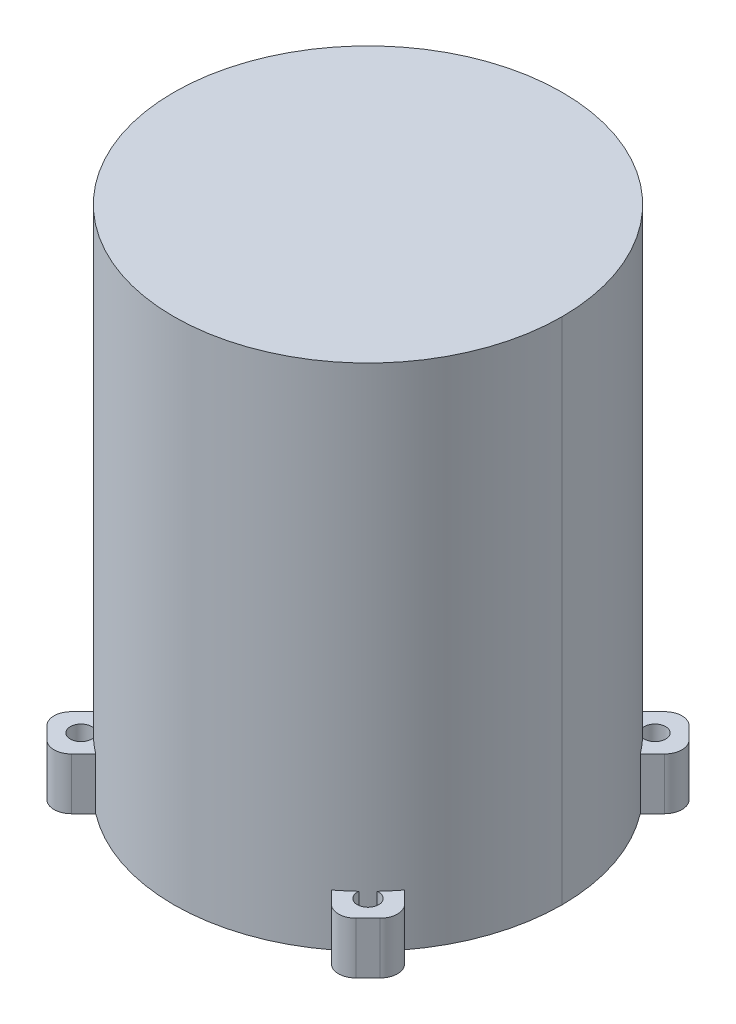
ISO-10303-21;
HEADER;
FILE_DESCRIPTION(('STEP AP214'),'2;1');
FILE_NAME('part.step','',(''),(''),'','','');
FILE_SCHEMA(('AUTOMOTIVE_DESIGN { 1 0 10303 214 1 1 1 1 }'));
ENDSEC;
DATA;
#1=APPLICATION_CONTEXT('core data for automotive mechanical design processes');
#2=APPLICATION_PROTOCOL_DEFINITION('international standard','automotive_design',2000,#1);
#3=PRODUCT_CONTEXT('',#1,'mechanical');
#4=PRODUCT('Part','Part','',(#3));
#5=PRODUCT_RELATED_PRODUCT_CATEGORY('part','',(#4));
#6=PRODUCT_DEFINITION_FORMATION('','',#4);
#7=PRODUCT_DEFINITION_CONTEXT('part definition',#1,'design');
#8=PRODUCT_DEFINITION('design','',#6,#7);
#9=PRODUCT_DEFINITION_SHAPE('','',#8);
#10=(LENGTH_UNIT() NAMED_UNIT(*) SI_UNIT(.MILLI.,.METRE.));
#11=(NAMED_UNIT(*) PLANE_ANGLE_UNIT() SI_UNIT($,.RADIAN.));
#12=(NAMED_UNIT(*) SI_UNIT($,.STERADIAN.) SOLID_ANGLE_UNIT());
#13=UNCERTAINTY_MEASURE_WITH_UNIT(LENGTH_MEASURE(1.E-05),#10,'distance_accuracy_value','');
#14=(GEOMETRIC_REPRESENTATION_CONTEXT(3) GLOBAL_UNCERTAINTY_ASSIGNED_CONTEXT((#13)) GLOBAL_UNIT_ASSIGNED_CONTEXT((#10,
#11,#12)) REPRESENTATION_CONTEXT('',''));
#15=CARTESIAN_POINT('',(0.,0.,0.));
#16=DIRECTION('',(0.,0.,1.));
#17=DIRECTION('',(1.,0.,0.));
#18=AXIS2_PLACEMENT_3D('',#15,#16,#17);
#19=CARTESIAN_POINT('',(1.0715872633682E-12,-119.0625,0.));
#20=DIRECTION('',(0.,-1.,0.));
#21=DIRECTION('',(0.,0.,-1.));
#22=AXIS2_PLACEMENT_3D('',#19,#20,#21);
#23=PLANE('',#22);
#24=CARTESIAN_POINT('',(1.0715872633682E-12,-119.0625,0.));
#25=DIRECTION('',(0.,-1.,0.));
#26=DIRECTION('',(0.,0.,-1.));
#27=AXIS2_PLACEMENT_3D('',#24,#25,#26);
#28=CIRCLE('',#27,7.9375);
#29=CARTESIAN_POINT('',(-7.93749999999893,-119.0625,0.));
#30=VERTEX_POINT('',#29);
#31=CARTESIAN_POINT('',(7.93750000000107,-119.0625,0.));
#32=VERTEX_POINT('',#31);
#33=EDGE_CURVE('E268',#30,#32,#28,.F.);
#34=ORIENTED_EDGE('',*,*,#33,.F.);
#35=CARTESIAN_POINT('',(1.0715872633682E-12,-119.0625,0.));
#36=DIRECTION('',(0.,-1.,0.));
#37=DIRECTION('',(0.,0.,-1.));
#38=AXIS2_PLACEMENT_3D('',#35,#36,#37);
#39=CIRCLE('',#38,7.9375);
#40=EDGE_CURVE('E19',#32,#30,#39,.F.);
#41=ORIENTED_EDGE('',*,*,#40,.F.);
#42=EDGE_LOOP('',(#34,#41));
#43=FACE_BOUND('',#42,.T.);
#44=ADVANCED_FACE('F16',(#43),#23,.T.);
#45=CARTESIAN_POINT('',(1.0715872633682E-12,-95.25,0.));
#46=DIRECTION('',(0.,-1.,0.));
#47=DIRECTION('',(0.,0.,-1.));
#48=AXIS2_PLACEMENT_3D('',#45,#46,#47);
#49=CYLINDRICAL_SURFACE('',#48,7.9375);
#50=DIRECTION('',(0.,-1.,0.));
#51=VECTOR('',#50,1.);
#52=CARTESIAN_POINT('',(-7.93749999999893,-95.25,0.));
#53=LINE('',#52,#51);
#54=CARTESIAN_POINT('',(-7.93749999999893,-71.4375,0.));
#55=VERTEX_POINT('',#54);
#56=EDGE_CURVE('E263',#55,#30,#53,.T.);
#57=ORIENTED_EDGE('',*,*,#56,.F.);
#58=CARTESIAN_POINT('',(1.0715872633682E-12,-71.4375,0.));
#59=DIRECTION('',(0.,-1.,0.));
#60=DIRECTION('',(0.,0.,-1.));
#61=AXIS2_PLACEMENT_3D('',#58,#59,#60);
#62=CIRCLE('',#61,7.9375);
#63=CARTESIAN_POINT('',(7.93750000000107,-71.4375,0.));
#64=VERTEX_POINT('',#63);
#65=EDGE_CURVE('E270',#64,#55,#62,.F.);
#66=ORIENTED_EDGE('',*,*,#65,.F.);
#67=DIRECTION('',(0.,-1.,0.));
#68=VECTOR('',#67,1.);
#69=CARTESIAN_POINT('',(7.93750000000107,-95.25,0.));
#70=LINE('',#69,#68);
#71=EDGE_CURVE('E266',#32,#64,#70,.F.);
#72=ORIENTED_EDGE('',*,*,#71,.F.);
#73=ORIENTED_EDGE('',*,*,#40,.T.);
#74=EDGE_LOOP('',(#57,#66,#72,#73));
#75=FACE_BOUND('',#74,.T.);
#76=ADVANCED_FACE('F261',(#75),#49,.T.);
#77=CARTESIAN_POINT('',(1.0715872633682E-12,-95.25,0.));
#78=DIRECTION('',(0.,-1.,0.));
#79=DIRECTION('',(0.,0.,-1.));
#80=AXIS2_PLACEMENT_3D('',#77,#78,#79);
#81=CYLINDRICAL_SURFACE('',#80,7.9375);
#82=ORIENTED_EDGE('',*,*,#56,.T.);
#83=ORIENTED_EDGE('',*,*,#33,.T.);
#84=ORIENTED_EDGE('',*,*,#71,.T.);
#85=CARTESIAN_POINT('',(1.0715872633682E-12,-71.4375,0.));
#86=DIRECTION('',(0.,-1.,0.));
#87=DIRECTION('',(0.,0.,-1.));
#88=AXIS2_PLACEMENT_3D('',#85,#86,#87);
#89=CIRCLE('',#88,7.9375);
#90=EDGE_CURVE('E273',#55,#64,#89,.F.);
#91=ORIENTED_EDGE('',*,*,#90,.F.);
#92=EDGE_LOOP('',(#82,#83,#84,#91));
#93=FACE_BOUND('',#92,.T.);
#94=ADVANCED_FACE('F271',(#93),#81,.T.);
#95=CARTESIAN_POINT('',(1.0715872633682E-12,-71.4375,0.));
#96=DIRECTION('',(0.,-1.,0.));
#97=DIRECTION('',(0.,0.,-1.));
#98=AXIS2_PLACEMENT_3D('',#95,#96,#97);
#99=PLANE('',#98);
#100=ORIENTED_EDGE('',*,*,#65,.T.);
#101=ORIENTED_EDGE('',*,*,#90,.T.);
#102=EDGE_LOOP('',(#100,#101));
#103=FACE_BOUND('',#102,.T.);
#104=CARTESIAN_POINT('',(1.0715872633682E-12,-71.4375,0.));
#105=DIRECTION('',(0.,-1.,0.));
#106=DIRECTION('',(0.,0.,-1.));
#107=AXIS2_PLACEMENT_3D('',#104,#105,#106);
#108=CIRCLE('',#107,57.15);
#109=CARTESIAN_POINT('',(-57.1499999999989,-71.4375,0.));
#110=VERTEX_POINT('',#109);
#111=CARTESIAN_POINT('',(57.1500000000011,-71.4375,0.));
#112=VERTEX_POINT('',#111);
#113=EDGE_CURVE('E421',#110,#112,#108,.F.);
#114=ORIENTED_EDGE('',*,*,#113,.F.);
#115=CARTESIAN_POINT('',(1.0715872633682E-12,-71.4375,0.));
#116=DIRECTION('',(0.,-1.,0.));
#117=DIRECTION('',(0.,0.,-1.));
#118=AXIS2_PLACEMENT_3D('',#115,#116,#117);
#119=CIRCLE('',#118,57.15);
#120=EDGE_CURVE('E416',#112,#110,#119,.F.);
#121=ORIENTED_EDGE('',*,*,#120,.F.);
#122=EDGE_LOOP('',(#114,#121));
#123=FACE_BOUND('',#122,.T.);
#124=ADVANCED_FACE('F450',(#103,#123),#99,.T.);
#125=CARTESIAN_POINT('',(0.,-49.2125,-7.21911419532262E-13));
#126=DIRECTION('',(0.,1.,0.));
#127=DIRECTION('',(0.,0.,1.));
#128=AXIS2_PLACEMENT_3D('',#125,#126,#127);
#129=PLANE('',#128);
#130=CARTESIAN_POINT('',(0.,-49.2125,0.));
#131=DIRECTION('',(0.,-1.,0.));
#132=DIRECTION('',(0.,0.,-1.));
#133=AXIS2_PLACEMENT_3D('',#130,#131,#132);
#134=CIRCLE('',#133,71.4375000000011);
#135=CARTESIAN_POINT('',(48.8397075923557,-49.2125,-52.1344355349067));
#136=VERTEX_POINT('',#135);
#137=CARTESIAN_POINT('',(43.3277222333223,-49.2125,-56.7981064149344));
#138=VERTEX_POINT('',#137);
#139=EDGE_CURVE('E406',#136,#138,#134,.F.);
#140=ORIENTED_EDGE('',*,*,#139,.F.);
#141=CARTESIAN_POINT('',(52.7590047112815,-49.2125,-52.7590047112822));
#142=DIRECTION('',(0.,-1.,0.));
#143=DIRECTION('',(0.,0.,-1.));
#144=AXIS2_PLACEMENT_3D('',#141,#142,#143);
#145=CIRCLE('',#144,3.96875);
#146=CARTESIAN_POINT('',(52.1344355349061,-49.2125,-48.8397075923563));
#147=VERTEX_POINT('',#146);
#148=EDGE_CURVE('E423',#136,#147,#145,.T.);
#149=ORIENTED_EDGE('',*,*,#148,.T.);
#150=CARTESIAN_POINT('',(0.,-49.2125,0.));
#151=DIRECTION('',(0.,-1.,0.));
#152=DIRECTION('',(0.,0.,-1.));
#153=AXIS2_PLACEMENT_3D('',#150,#151,#152);
#154=CIRCLE('',#153,71.4375000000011);
#155=CARTESIAN_POINT('',(56.7981064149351,-49.2125,-43.3277222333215));
#156=VERTEX_POINT('',#155);
#157=EDGE_CURVE('E411',#156,#147,#154,.F.);
#158=ORIENTED_EDGE('',*,*,#157,.F.);
#159=DIRECTION('',(0.707106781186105,0.,-0.70710678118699));
#160=VECTOR('',#159,1.);
#161=CARTESIAN_POINT('',(56.798106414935,-49.2125,-43.3277222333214));
#162=LINE('',#161,#160);
#163=CARTESIAN_POINT('',(61.2882344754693,-49.2125,-47.8178502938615));
#164=VERTEX_POINT('',#163);
#165=EDGE_CURVE('E445',#164,#156,#162,.F.);
#166=ORIENTED_EDGE('',*,*,#165,.F.);
#167=CARTESIAN_POINT('',(56.7981064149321,-49.2125,-52.3079783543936));
#168=DIRECTION('',(0.,-1.,0.));
#169=DIRECTION('',(0.,0.,-1.));
#170=AXIS2_PLACEMENT_3D('',#167,#168,#169);
#171=CIRCLE('',#170,6.35);
#172=CARTESIAN_POINT('',(61.2882344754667,-49.2125,-56.7981064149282));
#173=VERTEX_POINT('',#172);
#174=EDGE_CURVE('E441',#173,#164,#171,.T.);
#175=ORIENTED_EDGE('',*,*,#174,.F.);
#176=DIRECTION('',(-0.707106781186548,0.,-0.707106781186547));
#177=VECTOR('',#176,1.);
#178=CARTESIAN_POINT('',(61.2882344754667,-49.2125,-56.7981064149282));
#179=LINE('',#178,#177);
#180=CARTESIAN_POINT('',(56.7981064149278,-49.2125,-61.2882344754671));
#181=VERTEX_POINT('',#180);
#182=EDGE_CURVE('E514',#181,#173,#179,.F.);
#183=ORIENTED_EDGE('',*,*,#182,.F.);
#184=CARTESIAN_POINT('',(52.3079783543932,-49.2125,-56.7981064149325));
#185=DIRECTION('',(0.,-1.,0.));
#186=DIRECTION('',(0.,0.,-1.));
#187=AXIS2_PLACEMENT_3D('',#184,#185,#186);
#188=CIRCLE('',#187,6.35);
#189=CARTESIAN_POINT('',(47.8178502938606,-49.2125,-61.2882344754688));
#190=VERTEX_POINT('',#189);
#191=EDGE_CURVE('E436',#190,#181,#188,.T.);
#192=ORIENTED_EDGE('',*,*,#191,.F.);
#193=DIRECTION('',(-0.707106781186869,0.,0.707106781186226));
#194=VECTOR('',#193,1.);
#195=CARTESIAN_POINT('',(47.8178502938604,-49.2125,-61.2882344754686));
#196=LINE('',#195,#194);
#197=EDGE_CURVE('E509',#138,#190,#196,.F.);
#198=ORIENTED_EDGE('',*,*,#197,.F.);
#199=EDGE_LOOP('',(#140,#149,#158,#166,#175,#183,#192,#198));
#200=FACE_BOUND('',#199,.T.);
#201=ADVANCED_FACE('F453',(#200),#129,.T.);
#202=CARTESIAN_POINT('',(0.,-49.2125,-7.21911419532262E-13));
#203=DIRECTION('',(0.,1.,0.));
#204=DIRECTION('',(0.,0.,1.));
#205=AXIS2_PLACEMENT_3D('',#202,#203,#204);
#206=PLANE('',#205);
#207=CARTESIAN_POINT('',(0.,-49.2125,0.));
#208=DIRECTION('',(0.,-1.,0.));
#209=DIRECTION('',(0.,0.,-1.));
#210=AXIS2_PLACEMENT_3D('',#207,#208,#209);
#211=CIRCLE('',#210,71.4375000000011);
#212=CARTESIAN_POINT('',(-52.1344355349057,-49.2125,-48.8397075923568));
#213=VERTEX_POINT('',#212);
#214=CARTESIAN_POINT('',(-56.7981064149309,-49.2125,-43.3277222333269));
#215=VERTEX_POINT('',#214);
#216=EDGE_CURVE('E397',#213,#215,#211,.F.);
#217=ORIENTED_EDGE('',*,*,#216,.F.);
#218=CARTESIAN_POINT('',(-52.7590047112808,-49.2125,-52.7590047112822));
#219=DIRECTION('',(0.,-1.,0.));
#220=DIRECTION('',(0.,0.,-1.));
#221=AXIS2_PLACEMENT_3D('',#218,#219,#220);
#222=CIRCLE('',#221,3.96875);
#223=CARTESIAN_POINT('',(-48.8397075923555,-49.2125,-52.1344355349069));
#224=VERTEX_POINT('',#223);
#225=EDGE_CURVE('E446',#213,#224,#222,.T.);
#226=ORIENTED_EDGE('',*,*,#225,.T.);
#227=CARTESIAN_POINT('',(0.,-49.2125,0.));
#228=DIRECTION('',(0.,-1.,0.));
#229=DIRECTION('',(0.,0.,-1.));
#230=AXIS2_PLACEMENT_3D('',#227,#228,#229);
#231=CIRCLE('',#230,71.4375000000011);
#232=CARTESIAN_POINT('',(-43.3277222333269,-49.2125,-56.7981064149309));
#233=VERTEX_POINT('',#232);
#234=EDGE_CURVE('E401',#233,#224,#231,.F.);
#235=ORIENTED_EDGE('',*,*,#234,.F.);
#236=DIRECTION('',(-0.707106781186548,0.,-0.707106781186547));
#237=VECTOR('',#236,1.);
#238=CARTESIAN_POINT('',(-43.3277222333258,-49.2125,-56.7981064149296));
#239=LINE('',#238,#237);
#240=CARTESIAN_POINT('',(-47.8178502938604,-49.2125,-61.2882344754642));
#241=VERTEX_POINT('',#240);
#242=EDGE_CURVE('E435',#241,#233,#239,.F.);
#243=ORIENTED_EDGE('',*,*,#242,.F.);
#244=CARTESIAN_POINT('',(-52.307978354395,-49.2125,-56.7981064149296));
#245=DIRECTION('',(0.,-1.,0.));
#246=DIRECTION('',(0.,0.,-1.));
#247=AXIS2_PLACEMENT_3D('',#244,#245,#246);
#248=CIRCLE('',#247,6.35);
#249=CARTESIAN_POINT('',(-56.7981064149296,-49.2125,-61.2882344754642));
#250=VERTEX_POINT('',#249);
#251=EDGE_CURVE('E431',#250,#241,#248,.T.);
#252=ORIENTED_EDGE('',*,*,#251,.F.);
#253=DIRECTION('',(-0.707106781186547,0.,0.707106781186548));
#254=VECTOR('',#253,1.);
#255=CARTESIAN_POINT('',(-56.7981064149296,-49.2125,-61.2882344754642));
#256=LINE('',#255,#254);
#257=CARTESIAN_POINT('',(-61.2882344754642,-49.2125,-56.7981064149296));
#258=VERTEX_POINT('',#257);
#259=EDGE_CURVE('E499',#258,#250,#256,.F.);
#260=ORIENTED_EDGE('',*,*,#259,.F.);
#261=CARTESIAN_POINT('',(-56.7981064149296,-49.2125,-52.307978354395));
#262=DIRECTION('',(0.,-1.,0.));
#263=DIRECTION('',(0.,0.,-1.));
#264=AXIS2_PLACEMENT_3D('',#261,#262,#263);
#265=CIRCLE('',#264,6.35);
#266=CARTESIAN_POINT('',(-61.2882344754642,-49.2125,-47.8178502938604));
#267=VERTEX_POINT('',#266);
#268=EDGE_CURVE('E426',#267,#258,#265,.T.);
#269=ORIENTED_EDGE('',*,*,#268,.F.);
#270=DIRECTION('',(0.707106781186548,0.,0.707106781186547));
#271=VECTOR('',#270,1.);
#272=CARTESIAN_POINT('',(-61.2882344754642,-49.2125,-47.8178502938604));
#273=LINE('',#272,#271);
#274=EDGE_CURVE('E494',#215,#267,#273,.F.);
#275=ORIENTED_EDGE('',*,*,#274,.F.);
#276=EDGE_LOOP('',(#217,#226,#235,#243,#252,#260,#269,#275));
#277=FACE_BOUND('',#276,.T.);
#278=ADVANCED_FACE('F668',(#277),#206,.T.);
#279=CARTESIAN_POINT('',(-52.7590047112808,-49.2125,-52.7590047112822));
#280=DIRECTION('',(0.,-1.,0.));
#281=DIRECTION('',(0.,0.,-1.));
#282=AXIS2_PLACEMENT_3D('',#279,#280,#281);
#283=CYLINDRICAL_SURFACE('',#282,3.96875);
#284=ORIENTED_EDGE('',*,*,#225,.F.);
#285=DIRECTION('',(0.,-1.,0.));
#286=VECTOR('',#285,1.);
#287=CARTESIAN_POINT('',(-52.1344355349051,-49.2125,-48.8397075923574));
#288=LINE('',#287,#286);
#289=CARTESIAN_POINT('',(-52.1344355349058,-68.2625,-48.8397075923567));
#290=VERTEX_POINT('',#289);
#291=EDGE_CURVE('E400',#290,#213,#288,.F.);
#292=ORIENTED_EDGE('',*,*,#291,.F.);
#293=CARTESIAN_POINT('',(-52.7590047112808,-68.2625,-52.7590047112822));
#294=DIRECTION('',(0.,-1.,0.));
#295=DIRECTION('',(0.,0.,-1.));
#296=AXIS2_PLACEMENT_3D('',#293,#294,#295);
#297=CIRCLE('',#296,3.96875);
#298=CARTESIAN_POINT('',(-48.8397075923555,-68.2625,-52.1344355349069));
#299=VERTEX_POINT('',#298);
#300=EDGE_CURVE('E361',#290,#299,#297,.T.);
#301=ORIENTED_EDGE('',*,*,#300,.T.);
#302=DIRECTION('',(0.,-1.,0.));
#303=VECTOR('',#302,1.);
#304=CARTESIAN_POINT('',(-48.8397075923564,-49.2125,-52.1344355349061));
#305=LINE('',#304,#303);
#306=EDGE_CURVE('E404',#224,#299,#305,.T.);
#307=ORIENTED_EDGE('',*,*,#306,.F.);
#308=EDGE_LOOP('',(#284,#292,#301,#307));
#309=FACE_BOUND('',#308,.T.);
#310=ADVANCED_FACE('F885',(#309),#283,.F.);
#311=CARTESIAN_POINT('',(56.798106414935,-49.2125,-43.3277222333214));
#312=DIRECTION('',(0.70710678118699,0.,0.707106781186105));
#313=DIRECTION('',(0.707106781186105,0.,-0.70710678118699));
#314=AXIS2_PLACEMENT_3D('',#311,#312,#313);
#315=PLANE('',#314);
#316=ORIENTED_EDGE('',*,*,#165,.T.);
#317=DIRECTION('',(0.,-1.,0.));
#318=VECTOR('',#317,1.);
#319=CARTESIAN_POINT('',(56.7981064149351,-49.2125,-43.3277222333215));
#320=LINE('',#319,#318);
#321=CARTESIAN_POINT('',(56.7981064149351,-68.2625,-43.3277222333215));
#322=VERTEX_POINT('',#321);
#323=EDGE_CURVE('E415',#322,#156,#320,.F.);
#324=ORIENTED_EDGE('',*,*,#323,.F.);
#325=DIRECTION('',(0.707106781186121,0.,-0.707106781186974));
#326=VECTOR('',#325,1.);
#327=CARTESIAN_POINT('',(56.798106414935,-68.2625,-43.3277222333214));
#328=LINE('',#327,#326);
#329=CARTESIAN_POINT('',(61.2882344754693,-68.2625,-47.8178502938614));
#330=VERTEX_POINT('',#329);
#331=EDGE_CURVE('E357',#322,#330,#328,.T.);
#332=ORIENTED_EDGE('',*,*,#331,.T.);
#333=DIRECTION('',(0.,-1.,0.));
#334=VECTOR('',#333,1.);
#335=CARTESIAN_POINT('',(61.2882344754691,-49.2125,-47.8178502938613));
#336=LINE('',#335,#334);
#337=EDGE_CURVE('E444',#164,#330,#336,.T.);
#338=ORIENTED_EDGE('',*,*,#337,.F.);
#339=EDGE_LOOP('',(#316,#324,#332,#338));
#340=FACE_BOUND('',#339,.T.);
#341=ADVANCED_FACE('F878',(#340),#315,.T.);
#342=CARTESIAN_POINT('',(56.7981064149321,-49.2125,-52.3079783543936));
#343=DIRECTION('',(0.,-1.,0.));
#344=DIRECTION('',(0.,0.,-1.));
#345=AXIS2_PLACEMENT_3D('',#342,#343,#344);
#346=CYLINDRICAL_SURFACE('',#345,6.35);
#347=ORIENTED_EDGE('',*,*,#174,.T.);
#348=ORIENTED_EDGE('',*,*,#337,.T.);
#349=CARTESIAN_POINT('',(56.7981064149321,-68.2625,-52.3079783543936));
#350=DIRECTION('',(0.,-1.,0.));
#351=DIRECTION('',(0.,0.,-1.));
#352=AXIS2_PLACEMENT_3D('',#349,#350,#351);
#353=CIRCLE('',#352,6.35);
#354=CARTESIAN_POINT('',(61.2882344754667,-68.2625,-56.7981064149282));
#355=VERTEX_POINT('',#354);
#356=EDGE_CURVE('E355',#330,#355,#353,.F.);
#357=ORIENTED_EDGE('',*,*,#356,.T.);
#358=DIRECTION('',(0.,1.,0.));
#359=VECTOR('',#358,1.);
#360=CARTESIAN_POINT('',(61.2882344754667,-49.2125,-56.7981064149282));
#361=LINE('',#360,#359);
#362=EDGE_CURVE('E440',#173,#355,#361,.F.);
#363=ORIENTED_EDGE('',*,*,#362,.F.);
#364=EDGE_LOOP('',(#347,#348,#357,#363));
#365=FACE_BOUND('',#364,.T.);
#366=ADVANCED_FACE('F541',(#365),#346,.T.);
#367=CARTESIAN_POINT('',(61.2882344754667,-49.2125,-56.7981064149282));
#368=DIRECTION('',(0.707106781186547,0.,-0.707106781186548));
#369=DIRECTION('',(-0.707106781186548,0.,-0.707106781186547));
#370=AXIS2_PLACEMENT_3D('',#367,#368,#369);
#371=PLANE('',#370);
#372=ORIENTED_EDGE('',*,*,#182,.T.);
#373=ORIENTED_EDGE('',*,*,#362,.T.);
#374=DIRECTION('',(-0.707106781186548,0.,-0.707106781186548));
#375=VECTOR('',#374,1.);
#376=CARTESIAN_POINT('',(61.2882344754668,-68.2625,-56.7981064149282));
#377=LINE('',#376,#375);
#378=CARTESIAN_POINT('',(56.7981064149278,-68.2625,-61.2882344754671));
#379=VERTEX_POINT('',#378);
#380=EDGE_CURVE('E354',#355,#379,#377,.T.);
#381=ORIENTED_EDGE('',*,*,#380,.T.);
#382=DIRECTION('',(0.,-1.,0.));
#383=VECTOR('',#382,1.);
#384=CARTESIAN_POINT('',(56.7981064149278,-49.2125,-61.2882344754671));
#385=LINE('',#384,#383);
#386=EDGE_CURVE('E439',#181,#379,#385,.T.);
#387=ORIENTED_EDGE('',*,*,#386,.F.);
#388=EDGE_LOOP('',(#372,#373,#381,#387));
#389=FACE_BOUND('',#388,.T.);
#390=ADVANCED_FACE('F532',(#389),#371,.T.);
#391=CARTESIAN_POINT('',(52.3079783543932,-49.2125,-56.7981064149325));
#392=DIRECTION('',(0.,-1.,0.));
#393=DIRECTION('',(0.,0.,-1.));
#394=AXIS2_PLACEMENT_3D('',#391,#392,#393);
#395=CYLINDRICAL_SURFACE('',#394,6.35);
#396=ORIENTED_EDGE('',*,*,#191,.T.);
#397=ORIENTED_EDGE('',*,*,#386,.T.);
#398=CARTESIAN_POINT('',(52.3079783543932,-68.2625,-56.7981064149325));
#399=DIRECTION('',(0.,-1.,0.));
#400=DIRECTION('',(0.,0.,-1.));
#401=AXIS2_PLACEMENT_3D('',#398,#399,#400);
#402=CIRCLE('',#401,6.35);
#403=CARTESIAN_POINT('',(47.8178502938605,-68.2625,-61.2882344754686));
#404=VERTEX_POINT('',#403);
#405=EDGE_CURVE('E352',#379,#404,#402,.F.);
#406=ORIENTED_EDGE('',*,*,#405,.T.);
#407=DIRECTION('',(0.,1.,0.));
#408=VECTOR('',#407,1.);
#409=CARTESIAN_POINT('',(47.8178502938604,-49.2125,-61.2882344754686));
#410=LINE('',#409,#408);
#411=EDGE_CURVE('E506',#190,#404,#410,.F.);
#412=ORIENTED_EDGE('',*,*,#411,.F.);
#413=EDGE_LOOP('',(#396,#397,#406,#412));
#414=FACE_BOUND('',#413,.T.);
#415=ADVANCED_FACE('F675',(#414),#395,.T.);
#416=CARTESIAN_POINT('',(47.8178502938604,-49.2125,-61.2882344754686));
#417=DIRECTION('',(-0.707106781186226,0.,-0.707106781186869));
#418=DIRECTION('',(-0.707106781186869,0.,0.707106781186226));
#419=AXIS2_PLACEMENT_3D('',#416,#417,#418);
#420=PLANE('',#419);
#421=ORIENTED_EDGE('',*,*,#197,.T.);
#422=ORIENTED_EDGE('',*,*,#411,.T.);
#423=DIRECTION('',(-0.707106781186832,0.,0.707106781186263));
#424=VECTOR('',#423,1.);
#425=CARTESIAN_POINT('',(47.8178502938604,-68.2625,-61.2882344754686));
#426=LINE('',#425,#424);
#427=CARTESIAN_POINT('',(43.3277222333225,-68.2625,-56.7981064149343));
#428=VERTEX_POINT('',#427);
#429=EDGE_CURVE('E351',#404,#428,#426,.T.);
#430=ORIENTED_EDGE('',*,*,#429,.T.);
#431=DIRECTION('',(0.,-1.,0.));
#432=VECTOR('',#431,1.);
#433=CARTESIAN_POINT('',(43.3277222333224,-49.2125,-56.7981064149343));
#434=LINE('',#433,#432);
#435=EDGE_CURVE('E409',#138,#428,#434,.T.);
#436=ORIENTED_EDGE('',*,*,#435,.F.);
#437=EDGE_LOOP('',(#421,#422,#430,#436));
#438=FACE_BOUND('',#437,.T.);
#439=ADVANCED_FACE('F673',(#438),#420,.T.);
#440=CARTESIAN_POINT('',(-43.3277222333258,-49.2125,-56.7981064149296));
#441=DIRECTION('',(0.707106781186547,0.,-0.707106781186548));
#442=DIRECTION('',(-0.707106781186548,0.,-0.707106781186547));
#443=AXIS2_PLACEMENT_3D('',#440,#441,#442);
#444=PLANE('',#443);
#445=ORIENTED_EDGE('',*,*,#242,.T.);
#446=DIRECTION('',(0.,-1.,0.));
#447=VECTOR('',#446,1.);
#448=CARTESIAN_POINT('',(-43.3277222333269,-49.2125,-56.798106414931));
#449=LINE('',#448,#447);
#450=CARTESIAN_POINT('',(-43.3277222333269,-68.2625,-56.7981064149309));
#451=VERTEX_POINT('',#450);
#452=EDGE_CURVE('E405',#451,#233,#449,.F.);
#453=ORIENTED_EDGE('',*,*,#452,.F.);
#454=DIRECTION('',(-0.707106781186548,0.,-0.707106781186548));
#455=VECTOR('',#454,1.);
#456=CARTESIAN_POINT('',(-43.3277222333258,-68.2625,-56.7981064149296));
#457=LINE('',#456,#455);
#458=CARTESIAN_POINT('',(-47.8178502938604,-68.2625,-61.2882344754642));
#459=VERTEX_POINT('',#458);
#460=EDGE_CURVE('E347',#451,#459,#457,.T.);
#461=ORIENTED_EDGE('',*,*,#460,.T.);
#462=DIRECTION('',(0.,-1.,0.));
#463=VECTOR('',#462,1.);
#464=CARTESIAN_POINT('',(-47.8178502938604,-49.2125,-61.2882344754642));
#465=LINE('',#464,#463);
#466=EDGE_CURVE('E434',#241,#459,#465,.T.);
#467=ORIENTED_EDGE('',*,*,#466,.F.);
#468=EDGE_LOOP('',(#445,#453,#461,#467));
#469=FACE_BOUND('',#468,.T.);
#470=ADVANCED_FACE('F652',(#469),#444,.T.);
#471=CARTESIAN_POINT('',(-52.307978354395,-49.2125,-56.7981064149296));
#472=DIRECTION('',(0.,-1.,0.));
#473=DIRECTION('',(0.,0.,-1.));
#474=AXIS2_PLACEMENT_3D('',#471,#472,#473);
#475=CYLINDRICAL_SURFACE('',#474,6.35);
#476=ORIENTED_EDGE('',*,*,#251,.T.);
#477=ORIENTED_EDGE('',*,*,#466,.T.);
#478=CARTESIAN_POINT('',(-52.307978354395,-68.2625,-56.7981064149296));
#479=DIRECTION('',(0.,-1.,0.));
#480=DIRECTION('',(0.,0.,-1.));
#481=AXIS2_PLACEMENT_3D('',#478,#479,#480);
#482=CIRCLE('',#481,6.35);
#483=CARTESIAN_POINT('',(-56.7981064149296,-68.2625,-61.2882344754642));
#484=VERTEX_POINT('',#483);
#485=EDGE_CURVE('E345',#459,#484,#482,.F.);
#486=ORIENTED_EDGE('',*,*,#485,.T.);
#487=DIRECTION('',(0.,1.,0.));
#488=VECTOR('',#487,1.);
#489=CARTESIAN_POINT('',(-56.7981064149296,-49.2125,-61.2882344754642));
#490=LINE('',#489,#488);
#491=EDGE_CURVE('E430',#250,#484,#490,.F.);
#492=ORIENTED_EDGE('',*,*,#491,.F.);
#493=EDGE_LOOP('',(#476,#477,#486,#492));
#494=FACE_BOUND('',#493,.T.);
#495=ADVANCED_FACE('F656',(#494),#475,.T.);
#496=CARTESIAN_POINT('',(-56.7981064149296,-49.2125,-61.2882344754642));
#497=DIRECTION('',(-0.707106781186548,0.,-0.707106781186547));
#498=DIRECTION('',(-0.707106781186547,0.,0.707106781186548));
#499=AXIS2_PLACEMENT_3D('',#496,#497,#498);
#500=PLANE('',#499);
#501=ORIENTED_EDGE('',*,*,#259,.T.);
#502=ORIENTED_EDGE('',*,*,#491,.T.);
#503=DIRECTION('',(-0.707106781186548,0.,0.707106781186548));
#504=VECTOR('',#503,1.);
#505=CARTESIAN_POINT('',(-56.7981064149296,-68.2625,-61.2882344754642));
#506=LINE('',#505,#504);
#507=CARTESIAN_POINT('',(-61.2882344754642,-68.2625,-56.7981064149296));
#508=VERTEX_POINT('',#507);
#509=EDGE_CURVE('E344',#484,#508,#506,.T.);
#510=ORIENTED_EDGE('',*,*,#509,.T.);
#511=DIRECTION('',(0.,-1.,0.));
#512=VECTOR('',#511,1.);
#513=CARTESIAN_POINT('',(-61.2882344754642,-49.2125,-56.7981064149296));
#514=LINE('',#513,#512);
#515=EDGE_CURVE('E429',#258,#508,#514,.T.);
#516=ORIENTED_EDGE('',*,*,#515,.F.);
#517=EDGE_LOOP('',(#501,#502,#510,#516));
#518=FACE_BOUND('',#517,.T.);
#519=ADVANCED_FACE('F662',(#518),#500,.T.);
#520=CARTESIAN_POINT('',(-56.7981064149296,-49.2125,-52.307978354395));
#521=DIRECTION('',(0.,-1.,0.));
#522=DIRECTION('',(0.,0.,-1.));
#523=AXIS2_PLACEMENT_3D('',#520,#521,#522);
#524=CYLINDRICAL_SURFACE('',#523,6.35);
#525=ORIENTED_EDGE('',*,*,#268,.T.);
#526=ORIENTED_EDGE('',*,*,#515,.T.);
#527=CARTESIAN_POINT('',(-56.7981064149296,-68.2625,-52.307978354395));
#528=DIRECTION('',(0.,-1.,0.));
#529=DIRECTION('',(0.,0.,-1.));
#530=AXIS2_PLACEMENT_3D('',#527,#528,#529);
#531=CIRCLE('',#530,6.35);
#532=CARTESIAN_POINT('',(-61.2882344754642,-68.2625,-47.8178502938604));
#533=VERTEX_POINT('',#532);
#534=EDGE_CURVE('E342',#508,#533,#531,.F.);
#535=ORIENTED_EDGE('',*,*,#534,.T.);
#536=DIRECTION('',(0.,1.,0.));
#537=VECTOR('',#536,1.);
#538=CARTESIAN_POINT('',(-61.2882344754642,-49.2125,-47.8178502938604));
#539=LINE('',#538,#537);
#540=EDGE_CURVE('E488',#267,#533,#539,.F.);
#541=ORIENTED_EDGE('',*,*,#540,.F.);
#542=EDGE_LOOP('',(#525,#526,#535,#541));
#543=FACE_BOUND('',#542,.T.);
#544=ADVANCED_FACE('F664',(#543),#524,.T.);
#545=CARTESIAN_POINT('',(-61.2882344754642,-49.2125,-47.8178502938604));
#546=DIRECTION('',(-0.707106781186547,0.,0.707106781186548));
#547=DIRECTION('',(0.707106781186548,0.,0.707106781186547));
#548=AXIS2_PLACEMENT_3D('',#545,#546,#547);
#549=PLANE('',#548);
#550=ORIENTED_EDGE('',*,*,#274,.T.);
#551=ORIENTED_EDGE('',*,*,#540,.T.);
#552=DIRECTION('',(0.707106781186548,0.,0.707106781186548));
#553=VECTOR('',#552,1.);
#554=CARTESIAN_POINT('',(-61.2882344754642,-68.2625,-47.8178502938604));
#555=LINE('',#554,#553);
#556=CARTESIAN_POINT('',(-56.7981064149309,-68.2625,-43.3277222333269));
#557=VERTEX_POINT('',#556);
#558=EDGE_CURVE('E341',#533,#557,#555,.T.);
#559=ORIENTED_EDGE('',*,*,#558,.T.);
#560=DIRECTION('',(0.,-1.,0.));
#561=VECTOR('',#560,1.);
#562=CARTESIAN_POINT('',(-56.798106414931,-49.2125,-43.3277222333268));
#563=LINE('',#562,#561);
#564=EDGE_CURVE('E396',#215,#557,#563,.T.);
#565=ORIENTED_EDGE('',*,*,#564,.F.);
#566=EDGE_LOOP('',(#550,#551,#559,#565));
#567=FACE_BOUND('',#566,.T.);
#568=ADVANCED_FACE('F744',(#567),#549,.T.);
#569=CARTESIAN_POINT('',(-56.7981064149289,-49.2125,52.3079783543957));
#570=DIRECTION('',(0.,-1.,0.));
#571=DIRECTION('',(0.,0.,-1.));
#572=AXIS2_PLACEMENT_3D('',#569,#570,#571);
#573=CYLINDRICAL_SURFACE('',#572,6.35);
#574=CARTESIAN_POINT('',(-56.7981064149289,-49.2125,52.3079783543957));
#575=DIRECTION('',(0.,-1.,0.));
#576=DIRECTION('',(0.,0.,-1.));
#577=AXIS2_PLACEMENT_3D('',#574,#575,#576);
#578=CIRCLE('',#577,6.35);
#579=CARTESIAN_POINT('',(-61.2882344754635,-49.2125,47.8178502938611));
#580=VERTEX_POINT('',#579);
#581=CARTESIAN_POINT('',(-61.2882344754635,-49.2125,56.7981064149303));
#582=VERTEX_POINT('',#581);
#583=EDGE_CURVE('E387',#580,#582,#578,.F.);
#584=ORIENTED_EDGE('',*,*,#583,.F.);
#585=DIRECTION('',(0.,1.,0.));
#586=VECTOR('',#585,1.);
#587=CARTESIAN_POINT('',(-61.2882344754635,-49.2125,47.8178502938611));
#588=LINE('',#587,#586);
#589=CARTESIAN_POINT('',(-61.2882344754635,-68.2625,47.8178502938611));
#590=VERTEX_POINT('',#589);
#591=EDGE_CURVE('E393',#590,#580,#588,.T.);
#592=ORIENTED_EDGE('',*,*,#591,.F.);
#593=CARTESIAN_POINT('',(-56.7981064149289,-68.2625,52.3079783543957));
#594=DIRECTION('',(0.,-1.,0.));
#595=DIRECTION('',(0.,0.,-1.));
#596=AXIS2_PLACEMENT_3D('',#593,#594,#595);
#597=CIRCLE('',#596,6.35);
#598=CARTESIAN_POINT('',(-61.2882344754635,-68.2625,56.7981064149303));
#599=VERTEX_POINT('',#598);
#600=EDGE_CURVE('E336',#590,#599,#597,.F.);
#601=ORIENTED_EDGE('',*,*,#600,.T.);
#602=DIRECTION('',(0.,1.,0.));
#603=VECTOR('',#602,1.);
#604=CARTESIAN_POINT('',(-61.2882344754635,-49.2125,56.7981064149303));
#605=LINE('',#604,#603);
#606=EDGE_CURVE('E485',#582,#599,#605,.F.);
#607=ORIENTED_EDGE('',*,*,#606,.F.);
#608=EDGE_LOOP('',(#584,#592,#601,#607));
#609=FACE_BOUND('',#608,.T.);
#610=ADVANCED_FACE('F740',(#609),#573,.T.);
#611=CARTESIAN_POINT('',(-61.2882344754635,-49.2125,56.7981064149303));
#612=DIRECTION('',(-0.707106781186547,0.,0.707106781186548));
#613=DIRECTION('',(0.707106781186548,0.,0.707106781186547));
#614=AXIS2_PLACEMENT_3D('',#611,#612,#613);
#615=PLANE('',#614);
#616=DIRECTION('',(0.707106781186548,0.,0.707106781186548));
#617=VECTOR('',#616,1.);
#618=CARTESIAN_POINT('',(-61.2882344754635,-49.2125,56.7981064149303));
#619=LINE('',#618,#617);
#620=CARTESIAN_POINT('',(-56.7981064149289,-49.2125,61.2882344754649));
#621=VERTEX_POINT('',#620);
#622=EDGE_CURVE('E386',#582,#621,#619,.T.);
#623=ORIENTED_EDGE('',*,*,#622,.F.);
#624=ORIENTED_EDGE('',*,*,#606,.T.);
#625=DIRECTION('',(0.707106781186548,0.,0.707106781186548));
#626=VECTOR('',#625,1.);
#627=CARTESIAN_POINT('',(-61.2882344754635,-68.2625,56.7981064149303));
#628=LINE('',#627,#626);
#629=CARTESIAN_POINT('',(-56.7981064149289,-68.2625,61.2882344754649));
#630=VERTEX_POINT('',#629);
#631=EDGE_CURVE('E335',#599,#630,#628,.T.);
#632=ORIENTED_EDGE('',*,*,#631,.T.);
#633=DIRECTION('',(0.,-1.,0.));
#634=VECTOR('',#633,1.);
#635=CARTESIAN_POINT('',(-56.7981064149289,-49.2125,61.2882344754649));
#636=LINE('',#635,#634);
#637=EDGE_CURVE('E478',#621,#630,#636,.T.);
#638=ORIENTED_EDGE('',*,*,#637,.F.);
#639=EDGE_LOOP('',(#623,#624,#632,#638));
#640=FACE_BOUND('',#639,.T.);
#641=ADVANCED_FACE('F736',(#640),#615,.T.);
#642=CARTESIAN_POINT('',(-52.3079783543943,-49.2125,56.7981064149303));
#643=DIRECTION('',(0.,-1.,0.));
#644=DIRECTION('',(0.,0.,-1.));
#645=AXIS2_PLACEMENT_3D('',#642,#643,#644);
#646=CYLINDRICAL_SURFACE('',#645,6.35);
#647=CARTESIAN_POINT('',(-52.3079783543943,-49.2125,56.7981064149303));
#648=DIRECTION('',(0.,-1.,0.));
#649=DIRECTION('',(0.,0.,-1.));
#650=AXIS2_PLACEMENT_3D('',#647,#648,#649);
#651=CIRCLE('',#650,6.35);
#652=CARTESIAN_POINT('',(-47.8178502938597,-49.2125,61.2882344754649));
#653=VERTEX_POINT('',#652);
#654=EDGE_CURVE('E383',#621,#653,#651,.F.);
#655=ORIENTED_EDGE('',*,*,#654,.F.);
#656=ORIENTED_EDGE('',*,*,#637,.T.);
#657=CARTESIAN_POINT('',(-52.3079783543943,-68.2625,56.7981064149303));
#658=DIRECTION('',(0.,-1.,0.));
#659=DIRECTION('',(0.,0.,-1.));
#660=AXIS2_PLACEMENT_3D('',#657,#658,#659);
#661=CIRCLE('',#660,6.35);
#662=CARTESIAN_POINT('',(-47.8178502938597,-68.2625,61.2882344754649));
#663=VERTEX_POINT('',#662);
#664=EDGE_CURVE('E332',#630,#663,#661,.F.);
#665=ORIENTED_EDGE('',*,*,#664,.T.);
#666=DIRECTION('',(0.,1.,0.));
#667=VECTOR('',#666,1.);
#668=CARTESIAN_POINT('',(-47.8178502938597,-49.2125,61.2882344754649));
#669=LINE('',#668,#667);
#670=EDGE_CURVE('E480',#653,#663,#669,.F.);
#671=ORIENTED_EDGE('',*,*,#670,.F.);
#672=EDGE_LOOP('',(#655,#656,#665,#671));
#673=FACE_BOUND('',#672,.T.);
#674=ADVANCED_FACE('F732',(#673),#646,.T.);
#675=CARTESIAN_POINT('',(52.3079783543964,-49.2125,56.7981064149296));
#676=DIRECTION('',(0.,-1.,0.));
#677=DIRECTION('',(0.,0.,-1.));
#678=AXIS2_PLACEMENT_3D('',#675,#676,#677);
#679=CYLINDRICAL_SURFACE('',#678,6.35);
#680=CARTESIAN_POINT('',(52.3079783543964,-49.2125,56.7981064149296));
#681=DIRECTION('',(0.,-1.,0.));
#682=DIRECTION('',(0.,0.,-1.));
#683=AXIS2_PLACEMENT_3D('',#680,#681,#682);
#684=CIRCLE('',#683,6.35);
#685=CARTESIAN_POINT('',(47.8178502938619,-49.2125,61.2882344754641));
#686=VERTEX_POINT('',#685);
#687=CARTESIAN_POINT('',(56.7981064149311,-49.2125,61.2882344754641));
#688=VERTEX_POINT('',#687);
#689=EDGE_CURVE('E376',#686,#688,#684,.F.);
#690=ORIENTED_EDGE('',*,*,#689,.F.);
#691=DIRECTION('',(0.,1.,0.));
#692=VECTOR('',#691,1.);
#693=CARTESIAN_POINT('',(47.8178502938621,-49.2125,61.288234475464));
#694=LINE('',#693,#692);
#695=CARTESIAN_POINT('',(47.8178502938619,-68.2625,61.2882344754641));
#696=VERTEX_POINT('',#695);
#697=EDGE_CURVE('E382',#696,#686,#694,.T.);
#698=ORIENTED_EDGE('',*,*,#697,.F.);
#699=CARTESIAN_POINT('',(52.3079783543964,-68.2625,56.7981064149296));
#700=DIRECTION('',(0.,-1.,0.));
#701=DIRECTION('',(0.,0.,-1.));
#702=AXIS2_PLACEMENT_3D('',#699,#700,#701);
#703=CIRCLE('',#702,6.35);
#704=CARTESIAN_POINT('',(56.7981064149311,-68.2625,61.2882344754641));
#705=VERTEX_POINT('',#704);
#706=EDGE_CURVE('E329',#696,#705,#703,.F.);
#707=ORIENTED_EDGE('',*,*,#706,.T.);
#708=DIRECTION('',(0.,1.,0.));
#709=VECTOR('',#708,1.);
#710=CARTESIAN_POINT('',(56.798106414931,-49.2125,61.2882344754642));
#711=LINE('',#710,#709);
#712=EDGE_CURVE('E475',#688,#705,#711,.F.);
#713=ORIENTED_EDGE('',*,*,#712,.F.);
#714=EDGE_LOOP('',(#690,#698,#707,#713));
#715=FACE_BOUND('',#714,.T.);
#716=ADVANCED_FACE('F728',(#715),#679,.T.);
#717=CARTESIAN_POINT('',(56.798106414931,-49.2125,61.2882344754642));
#718=DIRECTION('',(0.707106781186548,0.,0.707106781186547));
#719=DIRECTION('',(0.707106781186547,0.,-0.707106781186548));
#720=AXIS2_PLACEMENT_3D('',#717,#718,#719);
#721=PLANE('',#720);
#722=DIRECTION('',(0.707106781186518,0.,-0.707106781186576));
#723=VECTOR('',#722,1.);
#724=CARTESIAN_POINT('',(56.798106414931,-49.2125,61.2882344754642));
#725=LINE('',#724,#723);
#726=CARTESIAN_POINT('',(61.2882344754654,-49.2125,56.7981064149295));
#727=VERTEX_POINT('',#726);
#728=EDGE_CURVE('E375',#688,#727,#725,.T.);
#729=ORIENTED_EDGE('',*,*,#728,.F.);
#730=ORIENTED_EDGE('',*,*,#712,.T.);
#731=DIRECTION('',(0.707106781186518,0.,-0.707106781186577));
#732=VECTOR('',#731,1.);
#733=CARTESIAN_POINT('',(56.7981064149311,-68.2625,61.2882344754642));
#734=LINE('',#733,#732);
#735=CARTESIAN_POINT('',(61.2882344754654,-68.2625,56.7981064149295));
#736=VERTEX_POINT('',#735);
#737=EDGE_CURVE('E328',#705,#736,#734,.T.);
#738=ORIENTED_EDGE('',*,*,#737,.T.);
#739=DIRECTION('',(0.,-1.,0.));
#740=VECTOR('',#739,1.);
#741=CARTESIAN_POINT('',(61.2882344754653,-49.2125,56.7981064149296));
#742=LINE('',#741,#740);
#743=EDGE_CURVE('E425',#727,#736,#742,.T.);
#744=ORIENTED_EDGE('',*,*,#743,.F.);
#745=EDGE_LOOP('',(#729,#730,#738,#744));
#746=FACE_BOUND('',#745,.T.);
#747=ADVANCED_FACE('F725',(#746),#721,.T.);
#748=CARTESIAN_POINT('',(56.7981064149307,-49.2125,52.307978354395));
#749=DIRECTION('',(0.,-1.,0.));
#750=DIRECTION('',(0.,0.,-1.));
#751=AXIS2_PLACEMENT_3D('',#748,#749,#750);
#752=CYLINDRICAL_SURFACE('',#751,6.35);
#753=CARTESIAN_POINT('',(56.7981064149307,-49.2125,52.307978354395));
#754=DIRECTION('',(0.,-1.,0.));
#755=DIRECTION('',(0.,0.,-1.));
#756=AXIS2_PLACEMENT_3D('',#753,#754,#755);
#757=CIRCLE('',#756,6.35);
#758=CARTESIAN_POINT('',(61.2882344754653,-49.2125,47.8178502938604));
#759=VERTEX_POINT('',#758);
#760=EDGE_CURVE('E372',#727,#759,#757,.F.);
#761=ORIENTED_EDGE('',*,*,#760,.F.);
#762=ORIENTED_EDGE('',*,*,#743,.T.);
#763=CARTESIAN_POINT('',(56.7981064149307,-68.2625,52.307978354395));
#764=DIRECTION('',(0.,-1.,0.));
#765=DIRECTION('',(0.,0.,-1.));
#766=AXIS2_PLACEMENT_3D('',#763,#764,#765);
#767=CIRCLE('',#766,6.35);
#768=CARTESIAN_POINT('',(61.2882344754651,-68.2625,47.8178502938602));
#769=VERTEX_POINT('',#768);
#770=EDGE_CURVE('E326',#736,#769,#767,.F.);
#771=ORIENTED_EDGE('',*,*,#770,.T.);
#772=DIRECTION('',(0.,1.,0.));
#773=VECTOR('',#772,1.);
#774=CARTESIAN_POINT('',(61.2882344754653,-49.2125,47.8178502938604));
#775=LINE('',#774,#773);
#776=EDGE_CURVE('E371',#759,#769,#775,.F.);
#777=ORIENTED_EDGE('',*,*,#776,.F.);
#778=EDGE_LOOP('',(#761,#762,#771,#777));
#779=FACE_BOUND('',#778,.T.);
#780=ADVANCED_FACE('F642',(#779),#752,.T.);
#781=CARTESIAN_POINT('',(52.7590047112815,-49.2125,-52.7590047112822));
#782=DIRECTION('',(0.,-1.,0.));
#783=DIRECTION('',(0.,0.,-1.));
#784=AXIS2_PLACEMENT_3D('',#781,#782,#783);
#785=CYLINDRICAL_SURFACE('',#784,3.96875);
#786=ORIENTED_EDGE('',*,*,#148,.F.);
#787=DIRECTION('',(0.,-1.,0.));
#788=VECTOR('',#787,1.);
#789=CARTESIAN_POINT('',(48.839707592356,-49.2125,-52.1344355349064));
#790=LINE('',#789,#788);
#791=CARTESIAN_POINT('',(48.8397075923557,-68.2625,-52.1344355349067));
#792=VERTEX_POINT('',#791);
#793=EDGE_CURVE('E410',#792,#136,#790,.F.);
#794=ORIENTED_EDGE('',*,*,#793,.F.);
#795=CARTESIAN_POINT('',(52.7590047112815,-68.2625,-52.7590047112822));
#796=DIRECTION('',(0.,-1.,0.));
#797=DIRECTION('',(0.,0.,-1.));
#798=AXIS2_PLACEMENT_3D('',#795,#796,#797);
#799=CIRCLE('',#798,3.96875);
#800=CARTESIAN_POINT('',(52.1344355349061,-68.2625,-48.8397075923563));
#801=VERTEX_POINT('',#800);
#802=EDGE_CURVE('E320',#792,#801,#799,.T.);
#803=ORIENTED_EDGE('',*,*,#802,.T.);
#804=DIRECTION('',(0.,-1.,0.));
#805=VECTOR('',#804,1.);
#806=CARTESIAN_POINT('',(52.1344355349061,-49.2125,-48.8397075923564));
#807=LINE('',#806,#805);
#808=EDGE_CURVE('E414',#147,#801,#807,.T.);
#809=ORIENTED_EDGE('',*,*,#808,.F.);
#810=EDGE_LOOP('',(#786,#794,#803,#809));
#811=FACE_BOUND('',#810,.T.);
#812=ADVANCED_FACE('F719',(#811),#785,.F.);
#813=CARTESIAN_POINT('',(1.0715872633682E-12,-69.85,0.));
#814=DIRECTION('',(0.,-1.,0.));
#815=DIRECTION('',(0.,0.,-1.));
#816=AXIS2_PLACEMENT_3D('',#813,#814,#815);
#817=CYLINDRICAL_SURFACE('',#816,57.15);
#818=DIRECTION('',(0.,-1.,0.));
#819=VECTOR('',#818,1.);
#820=CARTESIAN_POINT('',(-57.1499999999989,-69.85,0.));
#821=LINE('',#820,#819);
#822=CARTESIAN_POINT('',(-57.1499999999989,-68.2625,0.));
#823=VERTEX_POINT('',#822);
#824=EDGE_CURVE('E419',#110,#823,#821,.F.);
#825=ORIENTED_EDGE('',*,*,#824,.F.);
#826=ORIENTED_EDGE('',*,*,#113,.T.);
#827=DIRECTION('',(0.,-1.,0.));
#828=VECTOR('',#827,1.);
#829=CARTESIAN_POINT('',(57.1500000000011,-69.85,0.));
#830=LINE('',#829,#828);
#831=CARTESIAN_POINT('',(57.1500000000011,-68.2625,0.));
#832=VERTEX_POINT('',#831);
#833=EDGE_CURVE('E420',#832,#112,#830,.T.);
#834=ORIENTED_EDGE('',*,*,#833,.F.);
#835=CARTESIAN_POINT('',(1.0715872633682E-12,-68.2625,0.));
#836=DIRECTION('',(0.,-1.,0.));
#837=DIRECTION('',(0.,0.,-1.));
#838=AXIS2_PLACEMENT_3D('',#835,#836,#837);
#839=CIRCLE('',#838,57.15);
#840=EDGE_CURVE('E318',#832,#823,#839,.T.);
#841=ORIENTED_EDGE('',*,*,#840,.T.);
#842=EDGE_LOOP('',(#825,#826,#834,#841));
#843=FACE_BOUND('',#842,.T.);
#844=ADVANCED_FACE('F460',(#843),#817,.T.);
#845=CARTESIAN_POINT('',(1.0715872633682E-12,-69.85,0.));
#846=DIRECTION('',(0.,-1.,0.));
#847=DIRECTION('',(0.,0.,-1.));
#848=AXIS2_PLACEMENT_3D('',#845,#846,#847);
#849=CYLINDRICAL_SURFACE('',#848,57.15);
#850=ORIENTED_EDGE('',*,*,#824,.T.);
#851=CARTESIAN_POINT('',(1.0715872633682E-12,-68.2625,0.));
#852=DIRECTION('',(0.,-1.,0.));
#853=DIRECTION('',(0.,0.,-1.));
#854=AXIS2_PLACEMENT_3D('',#851,#852,#853);
#855=CIRCLE('',#854,57.15);
#856=EDGE_CURVE('E315',#823,#832,#855,.T.);
#857=ORIENTED_EDGE('',*,*,#856,.T.);
#858=ORIENTED_EDGE('',*,*,#833,.T.);
#859=ORIENTED_EDGE('',*,*,#120,.T.);
#860=EDGE_LOOP('',(#850,#857,#858,#859));
#861=FACE_BOUND('',#860,.T.);
#862=ADVANCED_FACE('F465',(#861),#849,.T.);
#863=CARTESIAN_POINT('',(1.0715872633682E-12,119.0625,0.));
#864=DIRECTION('',(0.,1.,0.));
#865=DIRECTION('',(0.,0.,1.));
#866=AXIS2_PLACEMENT_3D('',#863,#864,#865);
#867=PLANE('',#866);
#868=CARTESIAN_POINT('',(0.,119.0625,0.));
#869=DIRECTION('',(0.,-1.,0.));
#870=DIRECTION('',(0.,0.,-1.));
#871=AXIS2_PLACEMENT_3D('',#868,#869,#870);
#872=CIRCLE('',#871,71.4375000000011);
#873=CARTESIAN_POINT('',(-71.4375000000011,119.0625,-3.34968760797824E-12));
#874=VERTEX_POINT('',#873);
#875=CARTESIAN_POINT('',(71.437500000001,119.0625,1.66828259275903E-12));
#876=VERTEX_POINT('',#875);
#877=EDGE_CURVE('E394',#874,#876,#872,.T.);
#878=ORIENTED_EDGE('',*,*,#877,.F.);
#879=CARTESIAN_POINT('',(0.,119.0625,0.));
#880=DIRECTION('',(0.,-1.,0.));
#881=DIRECTION('',(0.,0.,-1.));
#882=AXIS2_PLACEMENT_3D('',#879,#880,#881);
#883=CIRCLE('',#882,71.4375000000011);
#884=EDGE_CURVE('E311',#876,#874,#883,.T.);
#885=ORIENTED_EDGE('',*,*,#884,.F.);
#886=EDGE_LOOP('',(#878,#885));
#887=FACE_BOUND('',#886,.T.);
#888=ADVANCED_FACE('F711',(#887),#867,.T.);
#889=CARTESIAN_POINT('',(0.,-49.2125,0.));
#890=DIRECTION('',(0.,-1.,0.));
#891=DIRECTION('',(0.,0.,-1.));
#892=AXIS2_PLACEMENT_3D('',#889,#890,#891);
#893=CYLINDRICAL_SURFACE('',#892,71.4375000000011);
#894=DIRECTION('',(0.,-1.,0.));
#895=VECTOR('',#894,1.);
#896=CARTESIAN_POINT('',(-71.4375000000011,-49.2125,-3.34968760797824E-12));
#897=LINE('',#896,#895);
#898=CARTESIAN_POINT('',(-71.4375000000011,-68.2625,-3.34968760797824E-12));
#899=VERTEX_POINT('',#898);
#900=EDGE_CURVE('E310',#874,#899,#897,.T.);
#901=ORIENTED_EDGE('',*,*,#900,.F.);
#902=ORIENTED_EDGE('',*,*,#877,.T.);
#903=DIRECTION('',(0.,-1.,0.));
#904=VECTOR('',#903,1.);
#905=CARTESIAN_POINT('',(71.437500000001,-49.2125,3.35843588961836E-12));
#906=LINE('',#905,#904);
#907=CARTESIAN_POINT('',(71.437500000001,-68.2625,1.67703087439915E-12));
#908=VERTEX_POINT('',#907);
#909=EDGE_CURVE('E314',#908,#876,#906,.F.);
#910=ORIENTED_EDGE('',*,*,#909,.F.);
#911=CARTESIAN_POINT('',(0.,-68.2625,0.));
#912=DIRECTION('',(0.,-1.,0.));
#913=DIRECTION('',(0.,0.,-1.));
#914=AXIS2_PLACEMENT_3D('',#911,#912,#913);
#915=CIRCLE('',#914,71.4375000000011);
#916=EDGE_CURVE('E358',#908,#322,#915,.F.);
#917=ORIENTED_EDGE('',*,*,#916,.T.);
#918=ORIENTED_EDGE('',*,*,#323,.T.);
#919=ORIENTED_EDGE('',*,*,#157,.T.);
#920=ORIENTED_EDGE('',*,*,#808,.T.);
#921=CARTESIAN_POINT('',(0.,-68.2625,0.));
#922=DIRECTION('',(0.,-1.,0.));
#923=DIRECTION('',(0.,0.,-1.));
#924=AXIS2_PLACEMENT_3D('',#921,#922,#923);
#925=CIRCLE('',#924,71.4375000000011);
#926=EDGE_CURVE('E323',#801,#792,#925,.F.);
#927=ORIENTED_EDGE('',*,*,#926,.T.);
#928=ORIENTED_EDGE('',*,*,#793,.T.);
#929=ORIENTED_EDGE('',*,*,#139,.T.);
#930=ORIENTED_EDGE('',*,*,#435,.T.);
#931=CARTESIAN_POINT('',(0.,-68.2625,0.));
#932=DIRECTION('',(0.,-1.,0.));
#933=DIRECTION('',(0.,0.,-1.));
#934=AXIS2_PLACEMENT_3D('',#931,#932,#933);
#935=CIRCLE('',#934,71.4375000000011);
#936=EDGE_CURVE('E348',#428,#451,#935,.F.);
#937=ORIENTED_EDGE('',*,*,#936,.T.);
#938=ORIENTED_EDGE('',*,*,#452,.T.);
#939=ORIENTED_EDGE('',*,*,#234,.T.);
#940=ORIENTED_EDGE('',*,*,#306,.T.);
#941=CARTESIAN_POINT('',(0.,-68.2625,0.));
#942=DIRECTION('',(0.,-1.,0.));
#943=DIRECTION('',(0.,0.,-1.));
#944=AXIS2_PLACEMENT_3D('',#941,#942,#943);
#945=CIRCLE('',#944,71.4375000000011);
#946=EDGE_CURVE('E364',#299,#290,#945,.F.);
#947=ORIENTED_EDGE('',*,*,#946,.T.);
#948=ORIENTED_EDGE('',*,*,#291,.T.);
#949=ORIENTED_EDGE('',*,*,#216,.T.);
#950=ORIENTED_EDGE('',*,*,#564,.T.);
#951=CARTESIAN_POINT('',(0.,-68.2625,0.));
#952=DIRECTION('',(0.,-1.,0.));
#953=DIRECTION('',(0.,0.,-1.));
#954=AXIS2_PLACEMENT_3D('',#951,#952,#953);
#955=CIRCLE('',#954,71.4375000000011);
#956=EDGE_CURVE('E339',#557,#899,#955,.F.);
#957=ORIENTED_EDGE('',*,*,#956,.T.);
#958=EDGE_LOOP('',(#901,#902,#910,#917,#918,#919,#920,#927,#928,#929,#930,#937,#938,#939,#940,
#947,#948,#949,#950,#957));
#959=FACE_BOUND('',#958,.T.);
#960=ADVANCED_FACE('F591',(#959),#893,.T.);
#961=CARTESIAN_POINT('',(-56.7981064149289,-49.2125,43.3277222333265));
#962=DIRECTION('',(-0.707106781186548,0.,-0.707106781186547));
#963=DIRECTION('',(-0.707106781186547,0.,0.707106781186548));
#964=AXIS2_PLACEMENT_3D('',#961,#962,#963);
#965=PLANE('',#964);
#966=DIRECTION('',(-0.707106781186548,0.,0.707106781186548));
#967=VECTOR('',#966,1.);
#968=CARTESIAN_POINT('',(-56.7981064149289,-49.2125,43.3277222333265));
#969=LINE('',#968,#967);
#970=CARTESIAN_POINT('',(-56.7981064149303,-49.2125,43.3277222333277));
#971=VERTEX_POINT('',#970);
#972=EDGE_CURVE('E390',#971,#580,#969,.T.);
#973=ORIENTED_EDGE('',*,*,#972,.F.);
#974=DIRECTION('',(0.,-1.,0.));
#975=VECTOR('',#974,1.);
#976=CARTESIAN_POINT('',(-56.7981064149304,-49.2125,43.3277222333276));
#977=LINE('',#976,#975);
#978=CARTESIAN_POINT('',(-56.7981064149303,-68.2625,43.3277222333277));
#979=VERTEX_POINT('',#978);
#980=EDGE_CURVE('E306',#979,#971,#977,.F.);
#981=ORIENTED_EDGE('',*,*,#980,.F.);
#982=DIRECTION('',(-0.707106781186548,0.,0.707106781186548));
#983=VECTOR('',#982,1.);
#984=CARTESIAN_POINT('',(-56.7981064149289,-68.2625,43.3277222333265));
#985=LINE('',#984,#983);
#986=EDGE_CURVE('E338',#979,#590,#985,.T.);
#987=ORIENTED_EDGE('',*,*,#986,.T.);
#988=ORIENTED_EDGE('',*,*,#591,.T.);
#989=EDGE_LOOP('',(#973,#981,#987,#988));
#990=FACE_BOUND('',#989,.T.);
#991=ADVANCED_FACE('F601',(#990),#965,.T.);
#992=CARTESIAN_POINT('',(-52.7590047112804,-49.2125,52.7590047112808));
#993=DIRECTION('',(0.,-1.,0.));
#994=DIRECTION('',(0.,0.,-1.));
#995=AXIS2_PLACEMENT_3D('',#992,#993,#994);
#996=CYLINDRICAL_SURFACE('',#995,3.96875);
#997=CARTESIAN_POINT('',(-52.7590047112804,-68.2625,52.7590047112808));
#998=DIRECTION('',(0.,-1.,0.));
#999=DIRECTION('',(0.,0.,-1.));
#1000=AXIS2_PLACEMENT_3D('',#997,#998,#999);
#1001=CIRCLE('',#1000,3.96875);
#1002=CARTESIAN_POINT('',(-48.8397075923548,-68.2625,52.1344355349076));
#1003=VERTEX_POINT('',#1002);
#1004=CARTESIAN_POINT('',(-52.1344355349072,-68.2625,48.8397075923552));
#1005=VERTEX_POINT('',#1004);
#1006=EDGE_CURVE('E367',#1003,#1005,#1001,.T.);
#1007=ORIENTED_EDGE('',*,*,#1006,.T.);
#1008=DIRECTION('',(0.,-1.,0.));
#1009=VECTOR('',#1008,1.);
#1010=CARTESIAN_POINT('',(-52.1344355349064,-49.2125,48.839707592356));
#1011=LINE('',#1010,#1009);
#1012=CARTESIAN_POINT('',(-52.1344355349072,-49.2125,48.8397075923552));
#1013=VERTEX_POINT('',#1012);
#1014=EDGE_CURVE('E302',#1013,#1005,#1011,.T.);
#1015=ORIENTED_EDGE('',*,*,#1014,.F.);
#1016=CARTESIAN_POINT('',(-52.7590047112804,-49.2125,52.7590047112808));
#1017=DIRECTION('',(0.,-1.,0.));
#1018=DIRECTION('',(0.,0.,-1.));
#1019=AXIS2_PLACEMENT_3D('',#1016,#1017,#1018);
#1020=CIRCLE('',#1019,3.96875);
#1021=CARTESIAN_POINT('',(-48.8397075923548,-49.2125,52.1344355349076));
#1022=VERTEX_POINT('',#1021);
#1023=EDGE_CURVE('E391',#1022,#1013,#1020,.T.);
#1024=ORIENTED_EDGE('',*,*,#1023,.F.);
#1025=DIRECTION('',(0.,-1.,0.));
#1026=VECTOR('',#1025,1.);
#1027=CARTESIAN_POINT('',(-48.8397075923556,-49.2125,52.1344355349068));
#1028=LINE('',#1027,#1026);
#1029=EDGE_CURVE('E298',#1003,#1022,#1028,.F.);
#1030=ORIENTED_EDGE('',*,*,#1029,.F.);
#1031=EDGE_LOOP('',(#1007,#1015,#1024,#1030));
#1032=FACE_BOUND('',#1031,.T.);
#1033=ADVANCED_FACE('F609',(#1032),#996,.F.);
#1034=CARTESIAN_POINT('',(0.,-49.2125,-7.21911419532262E-13));
#1035=DIRECTION('',(0.,1.,0.));
#1036=DIRECTION('',(0.,0.,1.));
#1037=AXIS2_PLACEMENT_3D('',#1034,#1035,#1036);
#1038=PLANE('',#1037);
#1039=ORIENTED_EDGE('',*,*,#654,.T.);
#1040=DIRECTION('',(0.707106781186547,0.,-0.707106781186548));
#1041=VECTOR('',#1040,1.);
#1042=CARTESIAN_POINT('',(-47.8178502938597,-49.2125,61.2882344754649));
#1043=LINE('',#1042,#1041);
#1044=CARTESIAN_POINT('',(-43.3277222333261,-49.2125,56.7981064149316));
#1045=VERTEX_POINT('',#1044);
#1046=EDGE_CURVE('E385',#1045,#653,#1043,.F.);
#1047=ORIENTED_EDGE('',*,*,#1046,.F.);
#1048=CARTESIAN_POINT('',(0.,-49.2125,0.));
#1049=DIRECTION('',(0.,-1.,0.));
#1050=DIRECTION('',(0.,0.,-1.));
#1051=AXIS2_PLACEMENT_3D('',#1048,#1049,#1050);
#1052=CIRCLE('',#1051,71.4375000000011);
#1053=EDGE_CURVE('E295',#1022,#1045,#1052,.F.);
#1054=ORIENTED_EDGE('',*,*,#1053,.F.);
#1055=ORIENTED_EDGE('',*,*,#1023,.T.);
#1056=CARTESIAN_POINT('',(0.,-49.2125,0.));
#1057=DIRECTION('',(0.,-1.,0.));
#1058=DIRECTION('',(0.,0.,-1.));
#1059=AXIS2_PLACEMENT_3D('',#1056,#1057,#1058);
#1060=CIRCLE('',#1059,71.4375000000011);
#1061=EDGE_CURVE('E303',#971,#1013,#1060,.F.);
#1062=ORIENTED_EDGE('',*,*,#1061,.F.);
#1063=ORIENTED_EDGE('',*,*,#972,.T.);
#1064=ORIENTED_EDGE('',*,*,#583,.T.);
#1065=ORIENTED_EDGE('',*,*,#622,.T.);
#1066=EDGE_LOOP('',(#1039,#1047,#1054,#1055,#1062,#1063,#1064,#1065));
#1067=FACE_BOUND('',#1066,.T.);
#1068=ADVANCED_FACE('F605',(#1067),#1038,.T.);
#1069=CARTESIAN_POINT('',(-47.8178502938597,-49.2125,61.2882344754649));
#1070=DIRECTION('',(0.707106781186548,0.,0.707106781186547));
#1071=DIRECTION('',(0.707106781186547,0.,-0.707106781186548));
#1072=AXIS2_PLACEMENT_3D('',#1069,#1070,#1071);
#1073=PLANE('',#1072);
#1074=ORIENTED_EDGE('',*,*,#1046,.T.);
#1075=ORIENTED_EDGE('',*,*,#670,.T.);
#1076=DIRECTION('',(0.707106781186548,0.,-0.707106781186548));
#1077=VECTOR('',#1076,1.);
#1078=CARTESIAN_POINT('',(-47.8178502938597,-68.2625,61.2882344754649));
#1079=LINE('',#1078,#1077);
#1080=CARTESIAN_POINT('',(-43.3277222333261,-68.2625,56.7981064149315));
#1081=VERTEX_POINT('',#1080);
#1082=EDGE_CURVE('E334',#663,#1081,#1079,.T.);
#1083=ORIENTED_EDGE('',*,*,#1082,.T.);
#1084=DIRECTION('',(0.,-1.,0.));
#1085=VECTOR('',#1084,1.);
#1086=CARTESIAN_POINT('',(-43.327722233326,-49.2125,56.7981064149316));
#1087=LINE('',#1086,#1085);
#1088=EDGE_CURVE('E294',#1045,#1081,#1087,.T.);
#1089=ORIENTED_EDGE('',*,*,#1088,.F.);
#1090=EDGE_LOOP('',(#1074,#1075,#1083,#1089));
#1091=FACE_BOUND('',#1090,.T.);
#1092=ADVANCED_FACE('F616',(#1091),#1073,.T.);
#1093=CARTESIAN_POINT('',(43.3277222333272,-49.2125,56.7981064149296));
#1094=DIRECTION('',(-0.707106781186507,0.,0.707106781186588));
#1095=DIRECTION('',(0.707106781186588,0.,0.707106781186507));
#1096=AXIS2_PLACEMENT_3D('',#1093,#1094,#1095);
#1097=PLANE('',#1096);
#1098=DIRECTION('',(0.707106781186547,0.,0.707106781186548));
#1099=VECTOR('',#1098,1.);
#1100=CARTESIAN_POINT('',(43.3277222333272,-49.2125,56.7981064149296));
#1101=LINE('',#1100,#1099);
#1102=CARTESIAN_POINT('',(43.3277222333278,-49.2125,56.7981064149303));
#1103=VERTEX_POINT('',#1102);
#1104=EDGE_CURVE('E379',#1103,#686,#1101,.T.);
#1105=ORIENTED_EDGE('',*,*,#1104,.F.);
#1106=DIRECTION('',(0.,-1.,0.));
#1107=VECTOR('',#1106,1.);
#1108=CARTESIAN_POINT('',(43.3277222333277,-49.2125,56.7981064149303));
#1109=LINE('',#1108,#1107);
#1110=CARTESIAN_POINT('',(43.3277222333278,-68.2625,56.7981064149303));
#1111=VERTEX_POINT('',#1110);
#1112=EDGE_CURVE('E290',#1111,#1103,#1109,.F.);
#1113=ORIENTED_EDGE('',*,*,#1112,.F.);
#1114=DIRECTION('',(0.707106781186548,0.,0.707106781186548));
#1115=VECTOR('',#1114,1.);
#1116=CARTESIAN_POINT('',(43.3277222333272,-68.2625,56.7981064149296));
#1117=LINE('',#1116,#1115);
#1118=EDGE_CURVE('E331',#1111,#696,#1117,.T.);
#1119=ORIENTED_EDGE('',*,*,#1118,.T.);
#1120=ORIENTED_EDGE('',*,*,#697,.T.);
#1121=EDGE_LOOP('',(#1105,#1113,#1119,#1120));
#1122=FACE_BOUND('',#1121,.T.);
#1123=ADVANCED_FACE('F627',(#1122),#1097,.T.);
#1124=CARTESIAN_POINT('',(52.7590047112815,-49.2125,52.7590047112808));
#1125=DIRECTION('',(0.,-1.,0.));
#1126=DIRECTION('',(0.,0.,-1.));
#1127=AXIS2_PLACEMENT_3D('',#1124,#1125,#1126);
#1128=CYLINDRICAL_SURFACE('',#1127,3.96875);
#1129=CARTESIAN_POINT('',(52.7590047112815,-68.2625,52.7590047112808));
#1130=DIRECTION('',(0.,-1.,0.));
#1131=DIRECTION('',(0.,0.,-1.));
#1132=AXIS2_PLACEMENT_3D('',#1129,#1130,#1131);
#1133=CIRCLE('',#1132,3.96875);
#1134=CARTESIAN_POINT('',(52.1344355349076,-68.2625,48.8397075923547));
#1135=VERTEX_POINT('',#1134);
#1136=CARTESIAN_POINT('',(48.8397075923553,-68.2625,52.134435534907));
#1137=VERTEX_POINT('',#1136);
#1138=EDGE_CURVE('E369',#1135,#1137,#1133,.T.);
#1139=ORIENTED_EDGE('',*,*,#1138,.T.);
#1140=DIRECTION('',(0.,-1.,0.));
#1141=VECTOR('',#1140,1.);
#1142=CARTESIAN_POINT('',(48.8397075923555,-49.2125,52.1344355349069));
#1143=LINE('',#1142,#1141);
#1144=CARTESIAN_POINT('',(48.8397075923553,-49.2125,52.134435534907));
#1145=VERTEX_POINT('',#1144);
#1146=EDGE_CURVE('E286',#1145,#1137,#1143,.T.);
#1147=ORIENTED_EDGE('',*,*,#1146,.F.);
#1148=CARTESIAN_POINT('',(52.7590047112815,-49.2125,52.7590047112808));
#1149=DIRECTION('',(0.,-1.,0.));
#1150=DIRECTION('',(0.,0.,-1.));
#1151=AXIS2_PLACEMENT_3D('',#1148,#1149,#1150);
#1152=CIRCLE('',#1151,3.96875);
#1153=CARTESIAN_POINT('',(52.1344355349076,-49.2125,48.8397075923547));
#1154=VERTEX_POINT('',#1153);
#1155=EDGE_CURVE('E380',#1154,#1145,#1152,.T.);
#1156=ORIENTED_EDGE('',*,*,#1155,.F.);
#1157=DIRECTION('',(0.,-1.,0.));
#1158=VECTOR('',#1157,1.);
#1159=CARTESIAN_POINT('',(52.1344355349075,-49.2125,48.8397075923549));
#1160=LINE('',#1159,#1158);
#1161=EDGE_CURVE('E282',#1135,#1154,#1160,.F.);
#1162=ORIENTED_EDGE('',*,*,#1161,.F.);
#1163=EDGE_LOOP('',(#1139,#1147,#1156,#1162));
#1164=FACE_BOUND('',#1163,.T.);
#1165=ADVANCED_FACE('F635',(#1164),#1128,.F.);
#1166=CARTESIAN_POINT('',(0.,-49.2125,-7.21911419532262E-13));
#1167=DIRECTION('',(0.,1.,0.));
#1168=DIRECTION('',(0.,0.,1.));
#1169=AXIS2_PLACEMENT_3D('',#1166,#1167,#1168);
#1170=PLANE('',#1169);
#1171=ORIENTED_EDGE('',*,*,#760,.T.);
#1172=DIRECTION('',(-0.707106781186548,0.,-0.707106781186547));
#1173=VECTOR('',#1172,1.);
#1174=CARTESIAN_POINT('',(61.2882344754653,-49.2125,47.8178502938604));
#1175=LINE('',#1174,#1173);
#1176=CARTESIAN_POINT('',(56.7981064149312,-49.2125,43.3277222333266));
#1177=VERTEX_POINT('',#1176);
#1178=EDGE_CURVE('E374',#1177,#759,#1175,.F.);
#1179=ORIENTED_EDGE('',*,*,#1178,.F.);
#1180=CARTESIAN_POINT('',(0.,-49.2125,0.));
#1181=DIRECTION('',(0.,-1.,0.));
#1182=DIRECTION('',(0.,0.,-1.));
#1183=AXIS2_PLACEMENT_3D('',#1180,#1181,#1182);
#1184=CIRCLE('',#1183,71.4375000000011);
#1185=EDGE_CURVE('E279',#1154,#1177,#1184,.F.);
#1186=ORIENTED_EDGE('',*,*,#1185,.F.);
#1187=ORIENTED_EDGE('',*,*,#1155,.T.);
#1188=CARTESIAN_POINT('',(0.,-49.2125,0.));
#1189=DIRECTION('',(0.,-1.,0.));
#1190=DIRECTION('',(0.,0.,-1.));
#1191=AXIS2_PLACEMENT_3D('',#1188,#1189,#1190);
#1192=CIRCLE('',#1191,71.4375000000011);
#1193=EDGE_CURVE('E287',#1103,#1145,#1192,.F.);
#1194=ORIENTED_EDGE('',*,*,#1193,.F.);
#1195=ORIENTED_EDGE('',*,*,#1104,.T.);
#1196=ORIENTED_EDGE('',*,*,#689,.T.);
#1197=ORIENTED_EDGE('',*,*,#728,.T.);
#1198=EDGE_LOOP('',(#1171,#1179,#1186,#1187,#1194,#1195,#1196,#1197));
#1199=FACE_BOUND('',#1198,.T.);
#1200=ADVANCED_FACE('F631',(#1199),#1170,.T.);
#1201=CARTESIAN_POINT('',(61.2882344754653,-49.2125,47.8178502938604));
#1202=DIRECTION('',(0.707106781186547,0.,-0.707106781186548));
#1203=DIRECTION('',(-0.707106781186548,0.,-0.707106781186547));
#1204=AXIS2_PLACEMENT_3D('',#1201,#1202,#1203);
#1205=PLANE('',#1204);
#1206=ORIENTED_EDGE('',*,*,#1178,.T.);
#1207=ORIENTED_EDGE('',*,*,#776,.T.);
#1208=DIRECTION('',(-0.707106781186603,0.,-0.707106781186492));
#1209=VECTOR('',#1208,1.);
#1210=CARTESIAN_POINT('',(61.2882344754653,-68.2625,47.8178502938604));
#1211=LINE('',#1210,#1209);
#1212=CARTESIAN_POINT('',(56.798106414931,-68.2625,43.3277222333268));
#1213=VERTEX_POINT('',#1212);
#1214=EDGE_CURVE('E34',#769,#1213,#1211,.T.);
#1215=ORIENTED_EDGE('',*,*,#1214,.T.);
#1216=DIRECTION('',(0.,-1.,0.));
#1217=VECTOR('',#1216,1.);
#1218=CARTESIAN_POINT('',(56.798106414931,-49.2125,43.3277222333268));
#1219=LINE('',#1218,#1217);
#1220=EDGE_CURVE('E25',#1177,#1213,#1219,.T.);
#1221=ORIENTED_EDGE('',*,*,#1220,.F.);
#1222=EDGE_LOOP('',(#1206,#1207,#1215,#1221));
#1223=FACE_BOUND('',#1222,.T.);
#1224=ADVANCED_FACE('F637',(#1223),#1205,.T.);
#1225=CARTESIAN_POINT('',(-56.7981064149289,-68.2625,43.3277222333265));
#1226=DIRECTION('',(0.,1.,0.));
#1227=DIRECTION('',(0.,0.,1.));
#1228=AXIS2_PLACEMENT_3D('',#1225,#1226,#1227);
#1229=PLANE('',#1228);
#1230=ORIENTED_EDGE('',*,*,#840,.F.);
#1231=ORIENTED_EDGE('',*,*,#856,.F.);
#1232=EDGE_LOOP('',(#1230,#1231));
#1233=FACE_BOUND('',#1232,.T.);
#1234=ORIENTED_EDGE('',*,*,#926,.F.);
#1235=ORIENTED_EDGE('',*,*,#802,.F.);
#1236=EDGE_LOOP('',(#1234,#1235));
#1237=FACE_BOUND('',#1236,.T.);
#1238=ORIENTED_EDGE('',*,*,#1214,.F.);
#1239=ORIENTED_EDGE('',*,*,#770,.F.);
#1240=ORIENTED_EDGE('',*,*,#737,.F.);
#1241=ORIENTED_EDGE('',*,*,#706,.F.);
#1242=ORIENTED_EDGE('',*,*,#1118,.F.);
#1243=CARTESIAN_POINT('',(0.,-68.2625,0.));
#1244=DIRECTION('',(0.,-1.,0.));
#1245=DIRECTION('',(0.,0.,-1.));
#1246=AXIS2_PLACEMENT_3D('',#1243,#1244,#1245);
#1247=CIRCLE('',#1246,71.4375000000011);
#1248=EDGE_CURVE('E291',#1081,#1111,#1247,.F.);
#1249=ORIENTED_EDGE('',*,*,#1248,.F.);
#1250=ORIENTED_EDGE('',*,*,#1082,.F.);
#1251=ORIENTED_EDGE('',*,*,#664,.F.);
#1252=ORIENTED_EDGE('',*,*,#631,.F.);
#1253=ORIENTED_EDGE('',*,*,#600,.F.);
#1254=ORIENTED_EDGE('',*,*,#986,.F.);
#1255=CARTESIAN_POINT('',(0.,-68.2625,0.));
#1256=DIRECTION('',(0.,-1.,0.));
#1257=DIRECTION('',(0.,0.,-1.));
#1258=AXIS2_PLACEMENT_3D('',#1255,#1256,#1257);
#1259=CIRCLE('',#1258,71.4375000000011);
#1260=EDGE_CURVE('E307',#899,#979,#1259,.F.);
#1261=ORIENTED_EDGE('',*,*,#1260,.F.);
#1262=ORIENTED_EDGE('',*,*,#956,.F.);
#1263=ORIENTED_EDGE('',*,*,#558,.F.);
#1264=ORIENTED_EDGE('',*,*,#534,.F.);
#1265=ORIENTED_EDGE('',*,*,#509,.F.);
#1266=ORIENTED_EDGE('',*,*,#485,.F.);
#1267=ORIENTED_EDGE('',*,*,#460,.F.);
#1268=ORIENTED_EDGE('',*,*,#936,.F.);
#1269=ORIENTED_EDGE('',*,*,#429,.F.);
#1270=ORIENTED_EDGE('',*,*,#405,.F.);
#1271=ORIENTED_EDGE('',*,*,#380,.F.);
#1272=ORIENTED_EDGE('',*,*,#356,.F.);
#1273=ORIENTED_EDGE('',*,*,#331,.F.);
#1274=ORIENTED_EDGE('',*,*,#916,.F.);
#1275=CARTESIAN_POINT('',(0.,-68.2625,0.));
#1276=DIRECTION('',(0.,-1.,0.));
#1277=DIRECTION('',(0.,0.,-1.));
#1278=AXIS2_PLACEMENT_3D('',#1275,#1276,#1277);
#1279=CIRCLE('',#1278,71.4375000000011);
#1280=EDGE_CURVE('E11',#1213,#908,#1279,.F.);
#1281=ORIENTED_EDGE('',*,*,#1280,.F.);
#1282=EDGE_LOOP('',(#1238,#1239,#1240,#1241,#1242,#1249,#1250,#1251,#1252,#1253,#1254,#1261,
#1262,#1263,#1264,#1265,#1266,#1267,#1268,#1269,#1270,#1271,#1272,#1273,#1274,#1281));
#1283=FACE_BOUND('',#1282,.T.);
#1284=ORIENTED_EDGE('',*,*,#946,.F.);
#1285=ORIENTED_EDGE('',*,*,#300,.F.);
#1286=EDGE_LOOP('',(#1284,#1285));
#1287=FACE_BOUND('',#1286,.T.);
#1288=CARTESIAN_POINT('',(0.,-68.2625,0.));
#1289=DIRECTION('',(0.,-1.,0.));
#1290=DIRECTION('',(0.,0.,-1.));
#1291=AXIS2_PLACEMENT_3D('',#1288,#1289,#1290);
#1292=CIRCLE('',#1291,71.4375000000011);
#1293=EDGE_CURVE('E299',#1005,#1003,#1292,.F.);
#1294=ORIENTED_EDGE('',*,*,#1293,.F.);
#1295=ORIENTED_EDGE('',*,*,#1006,.F.);
#1296=EDGE_LOOP('',(#1294,#1295));
#1297=FACE_BOUND('',#1296,.T.);
#1298=CARTESIAN_POINT('',(0.,-68.2625,0.));
#1299=DIRECTION('',(0.,-1.,0.));
#1300=DIRECTION('',(0.,0.,-1.));
#1301=AXIS2_PLACEMENT_3D('',#1298,#1299,#1300);
#1302=CIRCLE('',#1301,71.4375000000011);
#1303=EDGE_CURVE('E283',#1137,#1135,#1302,.F.);
#1304=ORIENTED_EDGE('',*,*,#1303,.F.);
#1305=ORIENTED_EDGE('',*,*,#1138,.F.);
#1306=EDGE_LOOP('',(#1304,#1305));
#1307=FACE_BOUND('',#1306,.T.);
#1308=ADVANCED_FACE('F545',(#1233,#1237,#1283,#1287,#1297,#1307),#1229,.F.);
#1309=CARTESIAN_POINT('',(0.,-49.2125,0.));
#1310=DIRECTION('',(0.,-1.,0.));
#1311=DIRECTION('',(0.,0.,-1.));
#1312=AXIS2_PLACEMENT_3D('',#1309,#1310,#1311);
#1313=CYLINDRICAL_SURFACE('',#1312,71.4375000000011);
#1314=ORIENTED_EDGE('',*,*,#1220,.T.);
#1315=ORIENTED_EDGE('',*,*,#1280,.T.);
#1316=ORIENTED_EDGE('',*,*,#909,.T.);
#1317=ORIENTED_EDGE('',*,*,#884,.T.);
#1318=ORIENTED_EDGE('',*,*,#900,.T.);
#1319=ORIENTED_EDGE('',*,*,#1260,.T.);
#1320=ORIENTED_EDGE('',*,*,#980,.T.);
#1321=ORIENTED_EDGE('',*,*,#1061,.T.);
#1322=ORIENTED_EDGE('',*,*,#1014,.T.);
#1323=ORIENTED_EDGE('',*,*,#1293,.T.);
#1324=ORIENTED_EDGE('',*,*,#1029,.T.);
#1325=ORIENTED_EDGE('',*,*,#1053,.T.);
#1326=ORIENTED_EDGE('',*,*,#1088,.T.);
#1327=ORIENTED_EDGE('',*,*,#1248,.T.);
#1328=ORIENTED_EDGE('',*,*,#1112,.T.);
#1329=ORIENTED_EDGE('',*,*,#1193,.T.);
#1330=ORIENTED_EDGE('',*,*,#1146,.T.);
#1331=ORIENTED_EDGE('',*,*,#1303,.T.);
#1332=ORIENTED_EDGE('',*,*,#1161,.T.);
#1333=ORIENTED_EDGE('',*,*,#1185,.T.);
#1334=EDGE_LOOP('',(#1314,#1315,#1316,#1317,#1318,#1319,#1320,#1321,#1322,#1323,#1324,#1325,
#1326,#1327,#1328,#1329,#1330,#1331,#1332,#1333));
#1335=FACE_BOUND('',#1334,.T.);
#1336=ADVANCED_FACE('F587',(#1335),#1313,.T.);
#1337=CLOSED_SHELL('',(#44,#76,#94,#124,#201,#278,#310,#341,#366,#390,#415,#439,#470,#495,#519,
#544,#568,#610,#641,#674,#716,#747,#780,#812,#844,#862,#888,#960,#991,#1033,#1068,#1092,#1123,
#1165,#1200,#1224,#1308,#1336));
#1338=MANIFOLD_SOLID_BREP('B1',#1337);
#1339=ADVANCED_BREP_SHAPE_REPRESENTATION('',(#18,#1338),#14);
#1340=SHAPE_DEFINITION_REPRESENTATION(#9,#1339);
ENDSEC;
END-ISO-10303-21;
